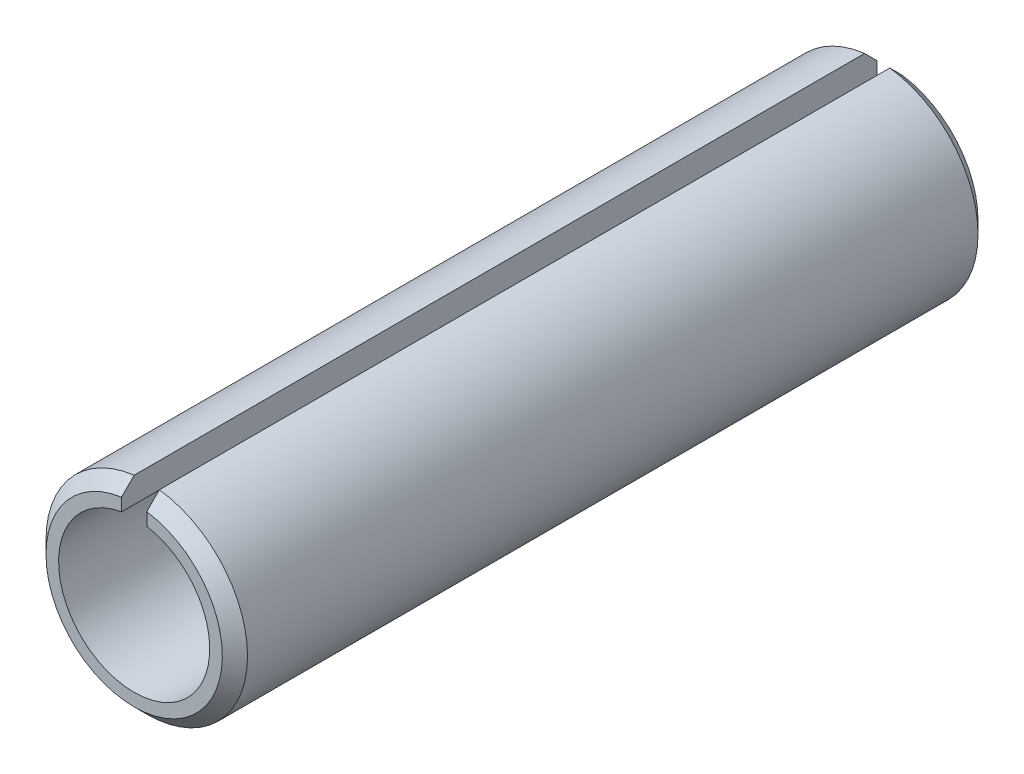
from build123d import *

# Parameters (mm, degrees)
EXTRUSION1_DEPTH      = 15
EXTRUSION1_DEPTH_BACK = 15
CHANFREIN1_SIZE       = 0.5


with BuildPart() as part:
    # Esquisse1 → Extrusion1 (new, two sides: drawn at the far end of the back side and taken through both)
    with BuildSketch(Plane.XY.offset(-EXTRUSION1_DEPTH_BACK)):
        with BuildLine():
            Line((0.5, 3.968626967), (0.5, 2.958039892))
            ThreePointArc((0.5, 2.958039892), (0, -3), (-0.5, 2.958039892))
            Line((-0.5, 2.958039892), (-0.5, 3.968626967))
            ThreePointArc((-0.5, 3.968626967), (0, -4), (0.5, 3.968626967))
        make_face()
    extrude(amount=EXTRUSION1_DEPTH + EXTRUSION1_DEPTH_BACK)

    # Chanfrein1
    chanfrein1_edges = [part.edges().sort_by_distance(p)[0] for p in [
        (0, -4, -15),
        (0, -4, 15),
    ]]
    chamfer(chanfrein1_edges, length=CHANFREIN1_SIZE)


solid = part.part
